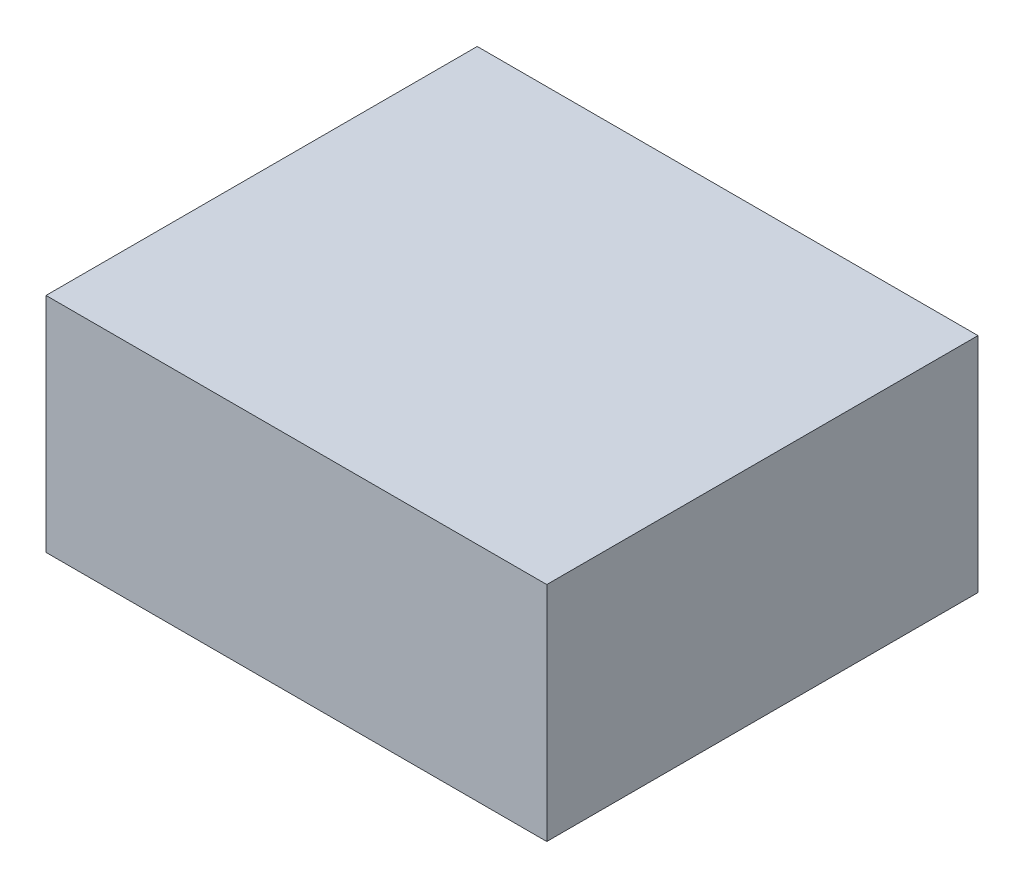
from build123d import *

# Parameters (mm, degrees)
SKETCH_1_W      = 18
SKETCH_1_H      = 15.5
EXTRUDE_1_DEPTH = 8


with BuildPart() as part:
    # Sketch 1 → Extrude 1 (new body)
    with BuildSketch(Plane(origin=(0, 0, 0), x_dir=(1, 0, 0), z_dir=(0, 1, 0))):
        Rectangle(SKETCH_1_W, SKETCH_1_H)
    extrude(amount=EXTRUDE_1_DEPTH)


solid = part.part
